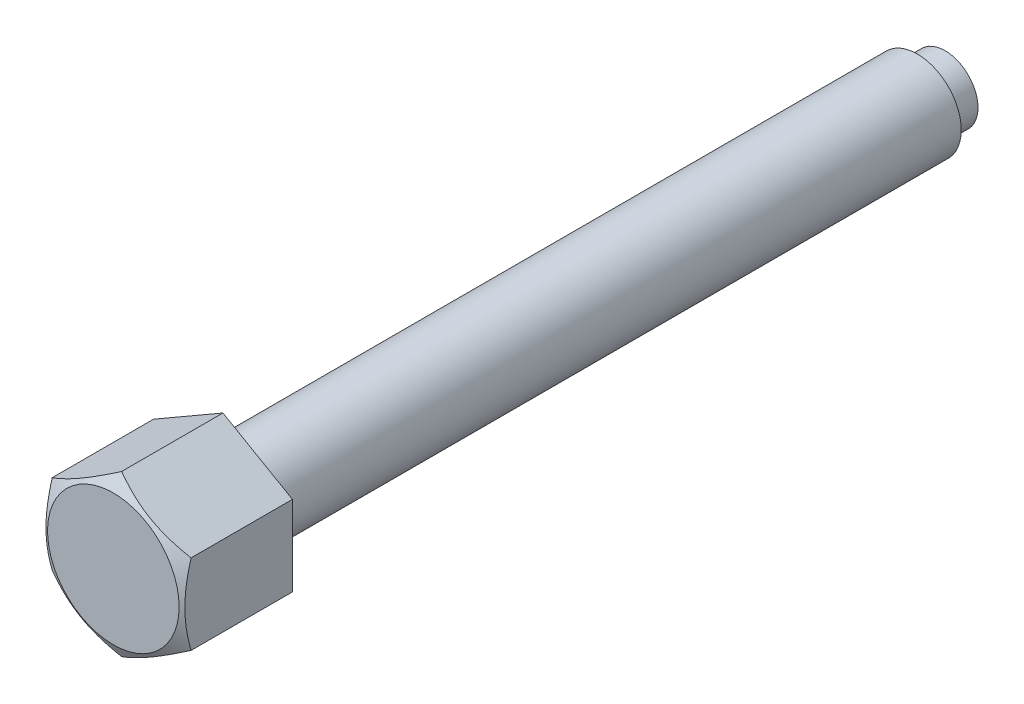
ISO-10303-21;
HEADER;
FILE_DESCRIPTION(('STEP AP214'),'2;1');
FILE_NAME('part.step','',(''),(''),'','','');
FILE_SCHEMA(('AUTOMOTIVE_DESIGN { 1 0 10303 214 1 1 1 1 }'));
ENDSEC;
DATA;
#1=APPLICATION_CONTEXT('core data for automotive mechanical design processes');
#2=APPLICATION_PROTOCOL_DEFINITION('international standard','automotive_design',2000,#1);
#3=PRODUCT_CONTEXT('',#1,'mechanical');
#4=PRODUCT('Part','Part','',(#3));
#5=PRODUCT_RELATED_PRODUCT_CATEGORY('part','',(#4));
#6=PRODUCT_DEFINITION_FORMATION('','',#4);
#7=PRODUCT_DEFINITION_CONTEXT('part definition',#1,'design');
#8=PRODUCT_DEFINITION('design','',#6,#7);
#9=PRODUCT_DEFINITION_SHAPE('','',#8);
#10=(LENGTH_UNIT() NAMED_UNIT(*) SI_UNIT(.MILLI.,.METRE.));
#11=(NAMED_UNIT(*) PLANE_ANGLE_UNIT() SI_UNIT($,.RADIAN.));
#12=(NAMED_UNIT(*) SI_UNIT($,.STERADIAN.) SOLID_ANGLE_UNIT());
#13=UNCERTAINTY_MEASURE_WITH_UNIT(LENGTH_MEASURE(1.E-05),#10,'distance_accuracy_value','');
#14=(GEOMETRIC_REPRESENTATION_CONTEXT(3) GLOBAL_UNCERTAINTY_ASSIGNED_CONTEXT((#13)) GLOBAL_UNIT_ASSIGNED_CONTEXT((#10,
#11,#12)) REPRESENTATION_CONTEXT('',''));
#15=CARTESIAN_POINT('',(0.,0.,0.));
#16=DIRECTION('',(0.,0.,1.));
#17=DIRECTION('',(1.,0.,0.));
#18=AXIS2_PLACEMENT_3D('',#15,#16,#17);
#19=CARTESIAN_POINT('',(0.,10.9696551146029,100.));
#20=DIRECTION('',(-0.5,-0.86602540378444,0.));
#21=DIRECTION('',(0.86602540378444,-0.5,0.));
#22=AXIS2_PLACEMENT_3D('',#19,#20,#21);
#23=PLANE('',#22);
#24=CARTESIAN_POINT('',(9.5002,5.4847120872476,113.862752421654));
#25=CARTESIAN_POINT('',(9.2913692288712,5.60528058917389,113.932351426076));
#26=CARTESIAN_POINT('',(9.0817598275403,5.72629863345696,113.998791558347));
#27=CARTESIAN_POINT('',(8.66086011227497,5.96930519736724,114.124477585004));
#28=CARTESIAN_POINT('',(8.44956926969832,6.09129402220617,114.183721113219));
#29=CARTESIAN_POINT('',(7.81229220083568,6.45922610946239,114.349510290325));
#30=CARTESIAN_POINT('',(7.38379023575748,6.70662183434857,114.443810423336));
#31=CARTESIAN_POINT('',(6.74255666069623,7.0768382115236,114.554386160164));
#32=CARTESIAN_POINT('',(6.53174078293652,7.19855281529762,114.585885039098));
#33=CARTESIAN_POINT('',(6.10913296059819,7.4425455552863,114.638706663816));
#34=CARTESIAN_POINT('',(5.89734099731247,7.56482370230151,114.66002921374));
#35=CARTESIAN_POINT('',(5.47340378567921,7.80958396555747,114.691951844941));
#36=CARTESIAN_POINT('',(5.26125925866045,7.93206566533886,114.702564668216));
#37=CARTESIAN_POINT('',(4.83677424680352,8.17714220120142,114.712842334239));
#38=CARTESIAN_POINT('',(4.62443376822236,8.2997370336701,114.712507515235));
#39=CARTESIAN_POINT('',(4.22745800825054,8.52893109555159,114.701651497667));
#40=CARTESIAN_POINT('',(4.04279470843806,8.63554650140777,114.692454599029));
#41=CARTESIAN_POINT('',(3.67389999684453,8.84852796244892,114.665959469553));
#42=CARTESIAN_POINT('',(3.48966861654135,8.95489399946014,114.648660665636));
#43=CARTESIAN_POINT('',(2.937688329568,9.27357996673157,114.585020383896));
#44=CARTESIAN_POINT('',(2.57091646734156,9.48533580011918,114.526942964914));
#45=CARTESIAN_POINT('',(1.83348217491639,9.91109368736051,114.381748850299));
#46=CARTESIAN_POINT('',(1.46291385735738,10.1250414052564,114.294016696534));
#47=CARTESIAN_POINT('',(0.727303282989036,10.5497463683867,114.094901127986));
#48=CARTESIAN_POINT('',(0.362251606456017,10.7605090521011,113.98356447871));
#49=CARTESIAN_POINT('',(-0.000199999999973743,10.9697705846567,113.862752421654));
#50=B_SPLINE_CURVE_WITH_KNOTS('',3,(#24,#25,#26,#27,#28,#29,#30,#31,#32,#33,#34,#35,#36,#37,#38,
#39,#40,#41,#42,#43,#44,#45,#46,#47,#48,#49),.UNSPECIFIED.,.F.,.F.,(4,2,2,2,2,2,2,2,2,2,2,2,4),
(0.,0.752880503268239,1.50600787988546,3.0154687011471,3.75167336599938,4.48789219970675,
5.22323407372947,5.95855322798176,6.59868084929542,7.23885375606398,8.52010929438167,
9.82978009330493,11.1368800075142),.UNSPECIFIED.);
#51=CARTESIAN_POINT('',(9.5,5.48482755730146,113.862819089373));
#52=VERTEX_POINT('',#51);
#53=CARTESIAN_POINT('',(0.,10.9696551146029,113.862819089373));
#54=VERTEX_POINT('',#53);
#55=EDGE_CURVE('E30',#52,#54,#50,.T.);
#56=ORIENTED_EDGE('',*,*,#55,.F.);
#57=DIRECTION('',(0.,0.,1.));
#58=VECTOR('',#57,1.);
#59=CARTESIAN_POINT('',(9.5,5.48482755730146,100.));
#60=LINE('',#59,#58);
#61=CARTESIAN_POINT('',(9.5,5.48482755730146,100.));
#62=VERTEX_POINT('',#61);
#63=EDGE_CURVE('E100',#62,#52,#60,.T.);
#64=ORIENTED_EDGE('',*,*,#63,.F.);
#65=DIRECTION('',(0.86602540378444,-0.5,0.));
#66=VECTOR('',#65,1.);
#67=CARTESIAN_POINT('',(0.,10.9696551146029,100.));
#68=LINE('',#67,#66);
#69=CARTESIAN_POINT('',(0.,10.9696551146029,100.));
#70=VERTEX_POINT('',#69);
#71=EDGE_CURVE('E38',#70,#62,#68,.T.);
#72=ORIENTED_EDGE('',*,*,#71,.F.);
#73=DIRECTION('',(0.,0.,1.));
#74=VECTOR('',#73,1.);
#75=CARTESIAN_POINT('',(0.,10.9696551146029,100.));
#76=LINE('',#75,#74);
#77=EDGE_CURVE('E88',#70,#54,#76,.T.);
#78=ORIENTED_EDGE('',*,*,#77,.T.);
#79=EDGE_LOOP('',(#56,#64,#72,#78));
#80=FACE_BOUND('',#79,.T.);
#81=ADVANCED_FACE('F15',(#80),#23,.F.);
#82=CARTESIAN_POINT('',(9.5,5.48482755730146,100.));
#83=DIRECTION('',(-1.,0.,0.));
#84=DIRECTION('',(0.,0.,1.));
#85=AXIS2_PLACEMENT_3D('',#82,#83,#84);
#86=PLANE('',#85);
#87=CARTESIAN_POINT('',(9.5,-14.6507799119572,110.114893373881));
#88=CARTESIAN_POINT('',(9.5,-14.4436612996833,110.215224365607));
#89=CARTESIAN_POINT('',(9.5,-14.2362974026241,110.315048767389));
#90=CARTESIAN_POINT('',(9.5,-13.8210278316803,110.513569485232));
#91=CARTESIAN_POINT('',(9.5,-13.6131221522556,110.612265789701));
#92=CARTESIAN_POINT('',(9.5,-12.9884590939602,110.906516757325));
#93=CARTESIAN_POINT('',(9.5,-12.5708182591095,111.100203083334));
#94=CARTESIAN_POINT('',(9.5,-11.7304015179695,111.482466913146));
#95=CARTESIAN_POINT('',(9.5,-11.3076099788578,111.671010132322));
#96=CARTESIAN_POINT('',(9.5,-10.4586359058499,112.040272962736));
#97=CARTESIAN_POINT('',(9.5,-10.0324535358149,112.220992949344));
#98=CARTESIAN_POINT('',(9.5,-9.1625964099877,112.578045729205));
#99=CARTESIAN_POINT('',(9.5,-8.71879180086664,112.754063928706));
#100=CARTESIAN_POINT('',(9.5,-7.82596128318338,113.092578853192));
#101=CARTESIAN_POINT('',(9.5,-7.3769347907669,113.255074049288));
#102=CARTESIAN_POINT('',(9.5,-6.47380793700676,113.562216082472));
#103=CARTESIAN_POINT('',(9.5,-6.01972024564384,113.706899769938));
#104=CARTESIAN_POINT('',(9.5,-5.10504877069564,113.973724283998));
#105=CARTESIAN_POINT('',(9.5,-4.64446710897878,114.09587229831));
#106=CARTESIAN_POINT('',(9.5,-3.71900232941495,114.311057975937));
#107=CARTESIAN_POINT('',(9.5,-3.25415609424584,114.404249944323));
#108=CARTESIAN_POINT('',(9.5,-2.55272029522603,114.518243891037));
#109=CARTESIAN_POINT('',(9.5,-2.31819612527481,114.551944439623));
#110=CARTESIAN_POINT('',(9.5,-1.84801022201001,114.610084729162));
#111=CARTESIAN_POINT('',(9.5,-1.61234860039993,114.634525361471));
#112=CARTESIAN_POINT('',(9.5,-1.14324613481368,114.673356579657));
#113=CARTESIAN_POINT('',(9.5,-0.909815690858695,114.687872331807));
#114=CARTESIAN_POINT('',(9.5,-0.442550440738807,114.707025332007));
#115=CARTESIAN_POINT('',(9.5,-0.208715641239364,114.711662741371));
#116=CARTESIAN_POINT('',(9.5,0.258941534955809,114.71094866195));
#117=CARTESIAN_POINT('',(9.5,0.492763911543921,114.705597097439));
#118=CARTESIAN_POINT('',(9.5,0.959977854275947,114.685034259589));
#119=CARTESIAN_POINT('',(9.5,1.19336939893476,114.66982250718));
#120=CARTESIAN_POINT('',(9.5,1.75678418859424,114.621518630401));
#121=CARTESIAN_POINT('',(9.5,2.0864015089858,114.583609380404));
#122=CARTESIAN_POINT('',(9.5,2.74313739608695,114.490208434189));
#123=CARTESIAN_POINT('',(9.5,3.07025560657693,114.434714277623));
#124=CARTESIAN_POINT('',(9.5,3.72169913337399,114.308117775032));
#125=CARTESIAN_POINT('',(9.5,4.04602201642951,114.237003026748));
#126=CARTESIAN_POINT('',(9.5,4.6913890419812,114.081330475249));
#127=CARTESIAN_POINT('',(9.5,5.01243323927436,113.996772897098));
#128=CARTESIAN_POINT('',(9.5,5.65827210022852,113.814277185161));
#129=CARTESIAN_POINT('',(9.5,5.98299492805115,113.716086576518));
#130=CARTESIAN_POINT('',(9.5,6.62924078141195,113.509739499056));
#131=CARTESIAN_POINT('',(9.5,6.95076378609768,113.401582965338));
#132=CARTESIAN_POINT('',(9.5,7.59077221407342,113.177005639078));
#133=CARTESIAN_POINT('',(9.5,7.90925864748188,113.06058771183));
#134=CARTESIAN_POINT('',(9.5,8.54360425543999,112.820839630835));
#135=CARTESIAN_POINT('',(9.5,8.85946345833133,112.697509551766));
#136=CARTESIAN_POINT('',(9.5,9.59494265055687,112.402539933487));
#137=CARTESIAN_POINT('',(9.5,10.0136502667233,112.228629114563));
#138=CARTESIAN_POINT('',(9.5,10.8475974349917,111.87265923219));
#139=CARTESIAN_POINT('',(9.5,11.2628367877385,111.690599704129));
#140=CARTESIAN_POINT('',(9.5,12.0904812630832,111.319938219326));
#141=CARTESIAN_POINT('',(9.5,12.5028857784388,111.131334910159));
#142=CARTESIAN_POINT('',(9.5,13.325239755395,110.74888317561));
#143=CARTESIAN_POINT('',(9.5,13.7351892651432,110.555034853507));
#144=CARTESIAN_POINT('',(9.5,14.5534588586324,110.162856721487));
#145=CARTESIAN_POINT('',(9.5,14.9617768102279,109.964522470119));
#146=CARTESIAN_POINT('',(9.5,15.7766753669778,109.564317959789));
#147=CARTESIAN_POINT('',(9.5,16.1832559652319,109.362447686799));
#148=CARTESIAN_POINT('',(9.5,17.4007037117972,108.752507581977));
#149=CARTESIAN_POINT('',(9.5,18.2093773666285,108.340059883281));
#150=CARTESIAN_POINT('',(9.5,19.7565044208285,107.54097414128));
#151=CARTESIAN_POINT('',(9.5,20.4952933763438,107.154982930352));
#152=CARTESIAN_POINT('',(9.5,21.9701265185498,106.37773711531));
#153=CARTESIAN_POINT('',(9.5,22.7061706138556,105.986482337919));
#154=CARTESIAN_POINT('',(9.5,24.1743637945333,105.200888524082));
#155=CARTESIAN_POINT('',(9.5,24.906517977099,104.806558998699));
#156=CARTESIAN_POINT('',(9.5,26.3690658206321,104.014738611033));
#157=CARTESIAN_POINT('',(9.5,27.0994595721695,103.617247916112));
#158=CARTESIAN_POINT('',(9.5,27.8292025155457,103.218573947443));
#159=B_SPLINE_CURVE_WITH_KNOTS('',3,(#87,#88,#89,#90,#91,#92,#93,#94,#95,#96,#97,#98,#99,#100,
#101,#102,#103,#104,#105,#106,#107,#108,#109,#110,#111,#112,#113,#114,#115,#116,#117,#118,#119,
#120,#121,#122,#123,#124,#125,#126,#127,#128,#129,#130,#131,#132,#133,#134,#135,#136,#137,#138,
#139,#140,#141,#142,#143,#144,#145,#146,#147,#148,#149,#150,#151,#152,#153,#154,#155,#156,#157,
#158),.UNSPECIFIED.,.F.,.F.,(4,2,2,2,2,2,2,2,2,2,2,2,2,2,2,2,2,2,2,2,2,2,2,2,2,2,2,2,2,2,2,2,2,
2,2,4),(0.,0.690418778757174,1.38084464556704,2.76190503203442,4.15062357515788,
5.53927541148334,6.97141195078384,8.40371018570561,9.832993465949,11.2618200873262,
12.6828965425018,13.3935418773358,14.1041187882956,14.8055603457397,15.5069904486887,
16.208425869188,16.9098953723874,17.9047134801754,18.8996708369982,19.8954210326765,
20.8911545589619,21.9086941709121,22.9262404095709,23.9434354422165,24.9606194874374,
26.3206685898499,27.6807953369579,29.0412048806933,30.4015876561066,31.7633820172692,
33.1251817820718,35.8484463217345,38.3490605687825,40.8497573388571,43.344525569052,
45.8391625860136),.UNSPECIFIED.);
#160=CARTESIAN_POINT('',(9.5,-5.48482755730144,113.862819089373));
#161=VERTEX_POINT('',#160);
#162=EDGE_CURVE('E147',#161,#52,#159,.T.);
#163=ORIENTED_EDGE('',*,*,#162,.F.);
#164=DIRECTION('',(0.,0.,1.));
#165=VECTOR('',#164,1.);
#166=CARTESIAN_POINT('',(9.5,-5.48482755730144,100.));
#167=LINE('',#166,#165);
#168=CARTESIAN_POINT('',(9.5,-5.48482755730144,100.));
#169=VERTEX_POINT('',#168);
#170=EDGE_CURVE('E97',#169,#161,#167,.T.);
#171=ORIENTED_EDGE('',*,*,#170,.F.);
#172=DIRECTION('',(0.,-1.,0.));
#173=VECTOR('',#172,1.);
#174=CARTESIAN_POINT('',(9.5,5.48482755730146,100.));
#175=LINE('',#174,#173);
#176=EDGE_CURVE('E162',#62,#169,#175,.T.);
#177=ORIENTED_EDGE('',*,*,#176,.F.);
#178=ORIENTED_EDGE('',*,*,#63,.T.);
#179=EDGE_LOOP('',(#163,#171,#177,#178));
#180=FACE_BOUND('',#179,.T.);
#181=ADVANCED_FACE('F126',(#180),#86,.F.);
#182=CARTESIAN_POINT('',(0.,-10.9696551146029,100.));
#183=DIRECTION('',(0.5,-0.866025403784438,0.));
#184=DIRECTION('',(0.866025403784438,0.5,0.));
#185=AXIS2_PLACEMENT_3D('',#182,#183,#184);
#186=PLANE('',#185);
#187=ORIENTED_EDGE('',*,*,#170,.T.);
#188=CARTESIAN_POINT('',(9.5002,-5.4847120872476,113.862752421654));
#189=CARTESIAN_POINT('',(9.2913692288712,-5.60528058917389,113.932351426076));
#190=CARTESIAN_POINT('',(9.0817598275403,-5.72629863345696,113.998791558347));
#191=CARTESIAN_POINT('',(8.66086011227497,-5.96930519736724,114.124477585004));
#192=CARTESIAN_POINT('',(8.44956926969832,-6.09129402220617,114.183721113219));
#193=CARTESIAN_POINT('',(7.81229220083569,-6.45922610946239,114.349510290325));
#194=CARTESIAN_POINT('',(7.38379023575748,-6.70662183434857,114.443810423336));
#195=CARTESIAN_POINT('',(6.74255666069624,-7.0768382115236,114.554386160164));
#196=CARTESIAN_POINT('',(6.53174078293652,-7.19855281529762,114.585885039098));
#197=CARTESIAN_POINT('',(6.10913296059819,-7.4425455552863,114.638706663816));
#198=CARTESIAN_POINT('',(5.89734099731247,-7.56482370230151,114.66002921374));
#199=CARTESIAN_POINT('',(5.47340378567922,-7.80958396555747,114.691951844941));
#200=CARTESIAN_POINT('',(5.26125925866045,-7.93206566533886,114.702564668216));
#201=CARTESIAN_POINT('',(4.83677424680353,-8.17714220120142,114.712842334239));
#202=CARTESIAN_POINT('',(4.62443376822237,-8.2997370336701,114.712507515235));
#203=CARTESIAN_POINT('',(4.22745800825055,-8.52893109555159,114.701651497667));
#204=CARTESIAN_POINT('',(4.04279470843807,-8.63554650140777,114.692454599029));
#205=CARTESIAN_POINT('',(3.67389999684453,-8.84852796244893,114.665959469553));
#206=CARTESIAN_POINT('',(3.48966861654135,-8.95489399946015,114.648660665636));
#207=CARTESIAN_POINT('',(2.93768832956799,-9.27357996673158,114.585020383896));
#208=CARTESIAN_POINT('',(2.57091646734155,-9.4853358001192,114.526942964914));
#209=CARTESIAN_POINT('',(1.83348217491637,-9.91109368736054,114.381748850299));
#210=CARTESIAN_POINT('',(1.46291385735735,-10.1250414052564,114.294016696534));
#211=CARTESIAN_POINT('',(0.727303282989,-10.5497463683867,114.094901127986));
#212=CARTESIAN_POINT('',(0.362251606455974,-10.7605090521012,113.98356447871));
#213=CARTESIAN_POINT('',(-0.000200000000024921,-10.9697705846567,113.862752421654));
#214=B_SPLINE_CURVE_WITH_KNOTS('',3,(#188,#189,#190,#191,#192,#193,#194,#195,#196,#197,#198,
#199,#200,#201,#202,#203,#204,#205,#206,#207,#208,#209,#210,#211,#212,#213),.UNSPECIFIED.,.F.,
.F.,(4,2,2,2,2,2,2,2,2,2,2,2,4),(0.,0.752880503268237,1.50600787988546,3.0154687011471,
3.75167336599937,4.48789219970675,5.22323407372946,5.95855322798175,6.59868084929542,
7.23885375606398,8.5201092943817,9.82978009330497,11.1368800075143),.UNSPECIFIED.);
#215=CARTESIAN_POINT('',(0.,-10.9696551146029,113.862819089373));
#216=VERTEX_POINT('',#215);
#217=EDGE_CURVE('E173',#161,#216,#214,.T.);
#218=ORIENTED_EDGE('',*,*,#217,.T.);
#219=DIRECTION('',(0.,0.,1.));
#220=VECTOR('',#219,1.);
#221=CARTESIAN_POINT('',(0.,-10.9696551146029,100.));
#222=LINE('',#221,#220);
#223=CARTESIAN_POINT('',(0.,-10.9696551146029,100.));
#224=VERTEX_POINT('',#223);
#225=EDGE_CURVE('E90',#224,#216,#222,.T.);
#226=ORIENTED_EDGE('',*,*,#225,.F.);
#227=DIRECTION('',(0.866025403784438,0.5,0.));
#228=VECTOR('',#227,1.);
#229=CARTESIAN_POINT('',(0.,-10.9696551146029,100.));
#230=LINE('',#229,#228);
#231=EDGE_CURVE('E159',#224,#169,#230,.T.);
#232=ORIENTED_EDGE('',*,*,#231,.T.);
#233=EDGE_LOOP('',(#187,#218,#226,#232));
#234=FACE_BOUND('',#233,.T.);
#235=ADVANCED_FACE('F131',(#234),#186,.T.);
#236=CARTESIAN_POINT('',(0.,-10.9696551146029,100.));
#237=DIRECTION('',(0.5,0.866025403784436,0.));
#238=DIRECTION('',(-0.866025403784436,0.5,0.));
#239=AXIS2_PLACEMENT_3D('',#236,#237,#238);
#240=PLANE('',#239);
#241=CARTESIAN_POINT('',(-9.5002,-5.48471208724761,113.862752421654));
#242=CARTESIAN_POINT('',(-9.29136922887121,-5.6052805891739,113.932351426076));
#243=CARTESIAN_POINT('',(-9.0817598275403,-5.72629863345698,113.998791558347));
#244=CARTESIAN_POINT('',(-8.66086011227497,-5.96930519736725,114.124477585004));
#245=CARTESIAN_POINT('',(-8.44956926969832,-6.09129402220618,114.183721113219));
#246=CARTESIAN_POINT('',(-7.81229220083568,-6.4592261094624,114.349510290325));
#247=CARTESIAN_POINT('',(-7.38379023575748,-6.70662183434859,114.443810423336));
#248=CARTESIAN_POINT('',(-6.74255666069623,-7.07683821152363,114.554386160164));
#249=CARTESIAN_POINT('',(-6.53174078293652,-7.19855281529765,114.585885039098));
#250=CARTESIAN_POINT('',(-6.10913296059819,-7.44254555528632,114.638706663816));
#251=CARTESIAN_POINT('',(-5.89734099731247,-7.56482370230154,114.66002921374));
#252=CARTESIAN_POINT('',(-5.47340378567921,-7.80958396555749,114.691951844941));
#253=CARTESIAN_POINT('',(-5.26125925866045,-7.93206566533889,114.702564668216));
#254=CARTESIAN_POINT('',(-4.83677424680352,-8.17714220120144,114.712842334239));
#255=CARTESIAN_POINT('',(-4.62443376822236,-8.29973703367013,114.712507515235));
#256=CARTESIAN_POINT('',(-4.22745800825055,-8.52893109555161,114.701651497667));
#257=CARTESIAN_POINT('',(-4.04279470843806,-8.6355465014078,114.692454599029));
#258=CARTESIAN_POINT('',(-3.67389999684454,-8.84852796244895,114.665959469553));
#259=CARTESIAN_POINT('',(-3.48966861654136,-8.95489399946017,114.648660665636));
#260=CARTESIAN_POINT('',(-2.937688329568,-9.2735799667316,114.585020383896));
#261=CARTESIAN_POINT('',(-2.57091646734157,-9.48533580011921,114.526942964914));
#262=CARTESIAN_POINT('',(-1.8334821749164,-9.91109368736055,114.381748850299));
#263=CARTESIAN_POINT('',(-1.46291385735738,-10.1250414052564,114.294016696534));
#264=CARTESIAN_POINT('',(-0.727303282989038,-10.5497463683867,114.094901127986));
#265=CARTESIAN_POINT('',(-0.362251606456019,-10.7605090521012,113.98356447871));
#266=CARTESIAN_POINT('',(0.000199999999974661,-10.9697705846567,113.862752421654));
#267=B_SPLINE_CURVE_WITH_KNOTS('',3,(#241,#242,#243,#244,#245,#246,#247,#248,#249,#250,#251,
#252,#253,#254,#255,#256,#257,#258,#259,#260,#261,#262,#263,#264,#265,#266),.UNSPECIFIED.,.F.,
.F.,(4,2,2,2,2,2,2,2,2,2,2,2,4),(0.,0.75288050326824,1.50600787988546,3.0154687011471,
3.75167336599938,4.48789219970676,5.22323407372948,5.95855322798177,6.59868084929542,
7.23885375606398,8.52010929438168,9.82978009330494,11.1368800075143),.UNSPECIFIED.);
#268=CARTESIAN_POINT('',(-9.5,-5.48482755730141,113.862819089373));
#269=VERTEX_POINT('',#268);
#270=EDGE_CURVE('E82',#269,#216,#267,.T.);
#271=ORIENTED_EDGE('',*,*,#270,.F.);
#272=DIRECTION('',(0.,0.,1.));
#273=VECTOR('',#272,1.);
#274=CARTESIAN_POINT('',(-9.5,-5.48482755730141,100.));
#275=LINE('',#274,#273);
#276=CARTESIAN_POINT('',(-9.5,-5.48482755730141,100.));
#277=VERTEX_POINT('',#276);
#278=EDGE_CURVE('E81',#277,#269,#275,.T.);
#279=ORIENTED_EDGE('',*,*,#278,.F.);
#280=DIRECTION('',(-0.866025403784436,0.5,0.));
#281=VECTOR('',#280,1.);
#282=CARTESIAN_POINT('',(0.,-10.9696551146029,100.));
#283=LINE('',#282,#281);
#284=EDGE_CURVE('E156',#224,#277,#283,.T.);
#285=ORIENTED_EDGE('',*,*,#284,.F.);
#286=ORIENTED_EDGE('',*,*,#225,.T.);
#287=EDGE_LOOP('',(#271,#279,#285,#286));
#288=FACE_BOUND('',#287,.T.);
#289=ADVANCED_FACE('F171',(#288),#240,.F.);
#290=CARTESIAN_POINT('',(-9.5,5.48482755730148,100.));
#291=DIRECTION('',(-1.,0.,0.));
#292=DIRECTION('',(0.,0.,1.));
#293=AXIS2_PLACEMENT_3D('',#290,#291,#292);
#294=PLANE('',#293);
#295=ORIENTED_EDGE('',*,*,#278,.T.);
#296=CARTESIAN_POINT('',(-9.5,-14.6507799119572,110.114893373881));
#297=CARTESIAN_POINT('',(-9.5,-14.4436612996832,110.215224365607));
#298=CARTESIAN_POINT('',(-9.5,-14.2362974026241,110.315048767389));
#299=CARTESIAN_POINT('',(-9.5,-13.8210278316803,110.513569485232));
#300=CARTESIAN_POINT('',(-9.5,-13.6131221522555,110.612265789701));
#301=CARTESIAN_POINT('',(-9.5,-12.9884590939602,110.906516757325));
#302=CARTESIAN_POINT('',(-9.5,-12.5708182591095,111.100203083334));
#303=CARTESIAN_POINT('',(-9.5,-11.7304015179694,111.482466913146));
#304=CARTESIAN_POINT('',(-9.5,-11.3076099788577,111.671010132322));
#305=CARTESIAN_POINT('',(-9.5,-10.4586359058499,112.040272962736));
#306=CARTESIAN_POINT('',(-9.5,-10.0324535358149,112.220992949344));
#307=CARTESIAN_POINT('',(-9.5,-9.16259640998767,112.578045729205));
#308=CARTESIAN_POINT('',(-9.5,-8.71879180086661,112.754063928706));
#309=CARTESIAN_POINT('',(-9.5,-7.82596128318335,113.092578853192));
#310=CARTESIAN_POINT('',(-9.5,-7.37693479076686,113.255074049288));
#311=CARTESIAN_POINT('',(-9.5,-6.47380793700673,113.562216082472));
#312=CARTESIAN_POINT('',(-9.5,-6.01972024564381,113.706899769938));
#313=CARTESIAN_POINT('',(-9.5,-5.10504877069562,113.973724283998));
#314=CARTESIAN_POINT('',(-9.5,-4.64446710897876,114.09587229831));
#315=CARTESIAN_POINT('',(-9.5,-3.71900232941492,114.311057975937));
#316=CARTESIAN_POINT('',(-9.5,-3.25415609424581,114.404249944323));
#317=CARTESIAN_POINT('',(-9.5,-2.552720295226,114.518243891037));
#318=CARTESIAN_POINT('',(-9.5,-2.31819612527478,114.551944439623));
#319=CARTESIAN_POINT('',(-9.5,-1.84801022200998,114.610084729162));
#320=CARTESIAN_POINT('',(-9.5,-1.6123486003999,114.634525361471));
#321=CARTESIAN_POINT('',(-9.5,-1.14324613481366,114.673356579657));
#322=CARTESIAN_POINT('',(-9.5,-0.909815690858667,114.687872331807));
#323=CARTESIAN_POINT('',(-9.5,-0.442550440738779,114.707025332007));
#324=CARTESIAN_POINT('',(-9.5,-0.208715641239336,114.711662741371));
#325=CARTESIAN_POINT('',(-9.5,0.258941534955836,114.71094866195));
#326=CARTESIAN_POINT('',(-9.5,0.492763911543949,114.705597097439));
#327=CARTESIAN_POINT('',(-9.5,0.959977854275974,114.685034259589));
#328=CARTESIAN_POINT('',(-9.5,1.19336939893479,114.66982250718));
#329=CARTESIAN_POINT('',(-9.5,1.75678418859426,114.621518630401));
#330=CARTESIAN_POINT('',(-9.5,2.08640150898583,114.583609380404));
#331=CARTESIAN_POINT('',(-9.5,2.74313739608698,114.490208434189));
#332=CARTESIAN_POINT('',(-9.5,3.07025560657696,114.434714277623));
#333=CARTESIAN_POINT('',(-9.5,3.72169913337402,114.308117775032));
#334=CARTESIAN_POINT('',(-9.5,4.04602201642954,114.237003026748));
#335=CARTESIAN_POINT('',(-9.5,4.69138904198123,114.081330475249));
#336=CARTESIAN_POINT('',(-9.5,5.01243323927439,113.996772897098));
#337=CARTESIAN_POINT('',(-9.5,5.65827210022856,113.814277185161));
#338=CARTESIAN_POINT('',(-9.5,5.98299492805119,113.716086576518));
#339=CARTESIAN_POINT('',(-9.5,6.62924078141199,113.509739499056));
#340=CARTESIAN_POINT('',(-9.5,6.95076378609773,113.401582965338));
#341=CARTESIAN_POINT('',(-9.5,7.59077221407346,113.177005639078));
#342=CARTESIAN_POINT('',(-9.5,7.90925864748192,113.06058771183));
#343=CARTESIAN_POINT('',(-9.5,8.54360425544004,112.820839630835));
#344=CARTESIAN_POINT('',(-9.5,8.85946345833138,112.697509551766));
#345=CARTESIAN_POINT('',(-9.5,9.59494265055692,112.402539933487));
#346=CARTESIAN_POINT('',(-9.5,10.0136502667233,112.228629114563));
#347=CARTESIAN_POINT('',(-9.5,10.8475974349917,111.87265923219));
#348=CARTESIAN_POINT('',(-9.5,11.2628367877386,111.690599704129));
#349=CARTESIAN_POINT('',(-9.5,12.0904812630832,111.319938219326));
#350=CARTESIAN_POINT('',(-9.5,12.5028857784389,111.131334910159));
#351=CARTESIAN_POINT('',(-9.5,13.3252397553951,110.74888317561));
#352=CARTESIAN_POINT('',(-9.5,13.7351892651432,110.555034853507));
#353=CARTESIAN_POINT('',(-9.5,14.5534588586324,110.162856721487));
#354=CARTESIAN_POINT('',(-9.5,14.9617768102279,109.964522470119));
#355=CARTESIAN_POINT('',(-9.5,15.7766753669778,109.564317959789));
#356=CARTESIAN_POINT('',(-9.5,16.1832559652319,109.362447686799));
#357=CARTESIAN_POINT('',(-9.5,17.4007037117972,108.752507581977));
#358=CARTESIAN_POINT('',(-9.5,18.2093773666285,108.340059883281));
#359=CARTESIAN_POINT('',(-9.5,19.7565044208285,107.54097414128));
#360=CARTESIAN_POINT('',(-9.5,20.4952933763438,107.154982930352));
#361=CARTESIAN_POINT('',(-9.5,21.9701265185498,106.37773711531));
#362=CARTESIAN_POINT('',(-9.5,22.7061706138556,105.986482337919));
#363=CARTESIAN_POINT('',(-9.5,24.1743637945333,105.200888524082));
#364=CARTESIAN_POINT('',(-9.5,24.906517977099,104.806558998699));
#365=CARTESIAN_POINT('',(-9.5,26.3690658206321,104.014738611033));
#366=CARTESIAN_POINT('',(-9.5,27.0994595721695,103.617247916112));
#367=CARTESIAN_POINT('',(-9.5,27.8292025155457,103.218573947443));
#368=B_SPLINE_CURVE_WITH_KNOTS('',3,(#296,#297,#298,#299,#300,#301,#302,#303,#304,#305,#306,
#307,#308,#309,#310,#311,#312,#313,#314,#315,#316,#317,#318,#319,#320,#321,#322,#323,#324,#325,
#326,#327,#328,#329,#330,#331,#332,#333,#334,#335,#336,#337,#338,#339,#340,#341,#342,#343,#344,
#345,#346,#347,#348,#349,#350,#351,#352,#353,#354,#355,#356,#357,#358,#359,#360,#361,#362,#363,
#364,#365,#366,#367),.UNSPECIFIED.,.F.,.F.,(4,2,2,2,2,2,2,2,2,2,2,2,2,2,2,2,2,2,2,2,2,2,2,2,2,2,
2,2,2,2,2,2,2,2,2,4),(0.,0.690418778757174,1.38084464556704,2.76190503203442,4.15062357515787,
5.53927541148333,6.97141195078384,8.4037101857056,9.83299346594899,11.2618200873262,
12.6828965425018,13.3935418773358,14.1041187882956,14.8055603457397,15.5069904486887,
16.208425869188,16.9098953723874,17.9047134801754,18.8996708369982,19.8954210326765,
20.8911545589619,21.9086941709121,22.9262404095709,23.9434354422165,24.9606194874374,
26.3206685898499,27.680795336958,29.0412048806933,30.4015876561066,31.7633820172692,
33.1251817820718,35.8484463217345,38.3490605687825,40.8497573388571,43.344525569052,
45.8391625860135),.UNSPECIFIED.);
#369=CARTESIAN_POINT('',(-9.5,5.48482755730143,113.862819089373));
#370=VERTEX_POINT('',#369);
#371=EDGE_CURVE('E69',#269,#370,#368,.T.);
#372=ORIENTED_EDGE('',*,*,#371,.T.);
#373=DIRECTION('',(0.,0.,1.));
#374=VECTOR('',#373,1.);
#375=CARTESIAN_POINT('',(-9.5,5.48482755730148,100.));
#376=LINE('',#375,#374);
#377=CARTESIAN_POINT('',(-9.5,5.48482755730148,100.));
#378=VERTEX_POINT('',#377);
#379=EDGE_CURVE('E79',#378,#370,#376,.T.);
#380=ORIENTED_EDGE('',*,*,#379,.F.);
#381=DIRECTION('',(0.,-1.,0.));
#382=VECTOR('',#381,1.);
#383=CARTESIAN_POINT('',(-9.5,5.48482755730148,100.));
#384=LINE('',#383,#382);
#385=EDGE_CURVE('E154',#378,#277,#384,.T.);
#386=ORIENTED_EDGE('',*,*,#385,.T.);
#387=EDGE_LOOP('',(#295,#372,#380,#386));
#388=FACE_BOUND('',#387,.T.);
#389=ADVANCED_FACE('F77',(#388),#294,.T.);
#390=CARTESIAN_POINT('',(0.,10.9696551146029,100.));
#391=DIRECTION('',(-0.5,0.866025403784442,0.));
#392=DIRECTION('',(-0.866025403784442,-0.5,0.));
#393=AXIS2_PLACEMENT_3D('',#390,#391,#392);
#394=PLANE('',#393);
#395=ORIENTED_EDGE('',*,*,#379,.T.);
#396=CARTESIAN_POINT('',(-9.5002,5.48471208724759,113.862752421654));
#397=CARTESIAN_POINT('',(-9.2913692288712,5.60528058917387,113.932351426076));
#398=CARTESIAN_POINT('',(-9.0817598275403,5.72629863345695,113.998791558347));
#399=CARTESIAN_POINT('',(-8.66086011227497,5.96930519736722,114.124477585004));
#400=CARTESIAN_POINT('',(-8.44956926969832,6.09129402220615,114.183721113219));
#401=CARTESIAN_POINT('',(-7.81229220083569,6.45922610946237,114.349510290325));
#402=CARTESIAN_POINT('',(-7.38379023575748,6.70662183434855,114.443810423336));
#403=CARTESIAN_POINT('',(-6.74255666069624,7.07683821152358,114.554386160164));
#404=CARTESIAN_POINT('',(-6.53174078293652,7.1985528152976,114.585885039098));
#405=CARTESIAN_POINT('',(-6.1091329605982,7.44254555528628,114.638706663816));
#406=CARTESIAN_POINT('',(-5.89734099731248,7.56482370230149,114.66002921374));
#407=CARTESIAN_POINT('',(-5.47340378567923,7.80958396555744,114.691951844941));
#408=CARTESIAN_POINT('',(-5.26125925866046,7.93206566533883,114.702564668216));
#409=CARTESIAN_POINT('',(-4.83677424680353,8.17714220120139,114.712842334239));
#410=CARTESIAN_POINT('',(-4.62443376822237,8.29973703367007,114.712507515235));
#411=CARTESIAN_POINT('',(-4.22745800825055,8.52893109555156,114.701651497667));
#412=CARTESIAN_POINT('',(-4.04279470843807,8.63554650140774,114.692454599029));
#413=CARTESIAN_POINT('',(-3.67389999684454,8.8485279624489,114.665959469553));
#414=CARTESIAN_POINT('',(-3.48966861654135,8.95489399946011,114.648660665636));
#415=CARTESIAN_POINT('',(-2.93768832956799,9.27357996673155,114.585020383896));
#416=CARTESIAN_POINT('',(-2.57091646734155,9.48533580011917,114.526942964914));
#417=CARTESIAN_POINT('',(-1.83348217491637,9.91109368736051,114.381748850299));
#418=CARTESIAN_POINT('',(-1.46291385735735,10.1250414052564,114.294016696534));
#419=CARTESIAN_POINT('',(-0.727303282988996,10.5497463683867,114.094901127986));
#420=CARTESIAN_POINT('',(-0.362251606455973,10.7605090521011,113.98356447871));
#421=CARTESIAN_POINT('',(0.000200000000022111,10.9697705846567,113.862752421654));
#422=B_SPLINE_CURVE_WITH_KNOTS('',3,(#396,#397,#398,#399,#400,#401,#402,#403,#404,#405,#406,
#407,#408,#409,#410,#411,#412,#413,#414,#415,#416,#417,#418,#419,#420,#421),.UNSPECIFIED.,.F.,
.F.,(4,2,2,2,2,2,2,2,2,2,2,2,4),(0.,0.752880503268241,1.50600787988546,3.01546870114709,
3.75167336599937,4.48789219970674,5.22323407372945,5.95855322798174,6.59868084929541,
7.23885375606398,8.52010929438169,9.82978009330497,11.1368800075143),.UNSPECIFIED.);
#423=EDGE_CURVE('E66',#370,#54,#422,.T.);
#424=ORIENTED_EDGE('',*,*,#423,.T.);
#425=ORIENTED_EDGE('',*,*,#77,.F.);
#426=DIRECTION('',(-0.866025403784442,-0.5,0.));
#427=VECTOR('',#426,1.);
#428=CARTESIAN_POINT('',(0.,10.9696551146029,100.));
#429=LINE('',#428,#427);
#430=EDGE_CURVE('E86',#70,#378,#429,.T.);
#431=ORIENTED_EDGE('',*,*,#430,.T.);
#432=EDGE_LOOP('',(#395,#424,#425,#431));
#433=FACE_BOUND('',#432,.T.);
#434=ADVANCED_FACE('F84',(#433),#394,.T.);
#435=CARTESIAN_POINT('',(0.,0.,9.));
#436=DIRECTION('',(0.,0.,1.));
#437=DIRECTION('',(1.,0.,0.));
#438=AXIS2_PLACEMENT_3D('',#435,#436,#437);
#439=SPHERICAL_SURFACE('',#438,9.);
#440=CARTESIAN_POINT('',(0.,0.,1.20577136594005));
#441=DIRECTION('',(0.,0.,1.));
#442=DIRECTION('',(1.,0.,0.));
#443=AXIS2_PLACEMENT_3D('',#440,#441,#442);
#444=CIRCLE('',#443,4.5);
#445=CARTESIAN_POINT('',(4.5,0.,1.20577136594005));
#446=VERTEX_POINT('',#445);
#447=EDGE_CURVE('E9',#446,#446,#444,.T.);
#448=ORIENTED_EDGE('',*,*,#447,.F.);
#449=EDGE_LOOP('',(#448));
#450=FACE_BOUND('',#449,.T.);
#451=ADVANCED_FACE('F17',(#450),#439,.T.);
#452=CARTESIAN_POINT('',(0.,0.,110.));
#453=DIRECTION('',(0.,0.,1.));
#454=DIRECTION('',(1.,0.,0.));
#455=AXIS2_PLACEMENT_3D('',#452,#453,#454);
#456=CYLINDRICAL_SURFACE('',#455,4.5);
#457=ORIENTED_EDGE('',*,*,#447,.T.);
#458=EDGE_LOOP('',(#457));
#459=FACE_BOUND('',#458,.T.);
#460=CARTESIAN_POINT('',(0.,0.,5.));
#461=DIRECTION('',(0.,0.,1.));
#462=DIRECTION('',(1.,0.,0.));
#463=AXIS2_PLACEMENT_3D('',#460,#461,#462);
#464=CIRCLE('',#463,4.5);
#465=CARTESIAN_POINT('',(4.5,0.,5.));
#466=VERTEX_POINT('',#465);
#467=EDGE_CURVE('E23',#466,#466,#464,.T.);
#468=ORIENTED_EDGE('',*,*,#467,.F.);
#469=EDGE_LOOP('',(#468));
#470=FACE_BOUND('',#469,.T.);
#471=ADVANCED_FACE('F113',(#459,#470),#456,.T.);
#472=CARTESIAN_POINT('',(4.5,0.,5.));
#473=DIRECTION('',(0.,0.,1.));
#474=DIRECTION('',(1.,0.,0.));
#475=AXIS2_PLACEMENT_3D('',#472,#473,#474);
#476=PLANE('',#475);
#477=CARTESIAN_POINT('',(0.,0.,5.));
#478=DIRECTION('',(0.,0.,1.));
#479=DIRECTION('',(1.,0.,0.));
#480=AXIS2_PLACEMENT_3D('',#477,#478,#479);
#481=CIRCLE('',#480,6.);
#482=CARTESIAN_POINT('',(6.,0.,5.));
#483=VERTEX_POINT('',#482);
#484=EDGE_CURVE('E106',#483,#483,#481,.T.);
#485=ORIENTED_EDGE('',*,*,#484,.F.);
#486=EDGE_LOOP('',(#485));
#487=FACE_BOUND('',#486,.T.);
#488=ORIENTED_EDGE('',*,*,#467,.T.);
#489=EDGE_LOOP('',(#488));
#490=FACE_BOUND('',#489,.T.);
#491=ADVANCED_FACE('F111',(#487,#490),#476,.F.);
#492=CARTESIAN_POINT('',(0.,0.,110.));
#493=DIRECTION('',(0.,0.,1.));
#494=DIRECTION('',(1.,0.,0.));
#495=AXIS2_PLACEMENT_3D('',#492,#493,#494);
#496=CYLINDRICAL_SURFACE('',#495,6.);
#497=CARTESIAN_POINT('',(0.,0.,100.));
#498=DIRECTION('',(0.,0.,1.));
#499=DIRECTION('',(1.,0.,0.));
#500=AXIS2_PLACEMENT_3D('',#497,#498,#499);
#501=CIRCLE('',#500,6.);
#502=CARTESIAN_POINT('',(6.,0.,100.));
#503=VERTEX_POINT('',#502);
#504=EDGE_CURVE('E103',#503,#503,#501,.T.);
#505=ORIENTED_EDGE('',*,*,#504,.F.);
#506=EDGE_LOOP('',(#505));
#507=FACE_BOUND('',#506,.T.);
#508=ORIENTED_EDGE('',*,*,#484,.T.);
#509=EDGE_LOOP('',(#508));
#510=FACE_BOUND('',#509,.T.);
#511=ADVANCED_FACE('F121',(#507,#510),#496,.T.);
#512=CARTESIAN_POINT('',(6.,0.,100.));
#513=DIRECTION('',(0.,0.,1.));
#514=DIRECTION('',(1.,0.,0.));
#515=AXIS2_PLACEMENT_3D('',#512,#513,#514);
#516=PLANE('',#515);
#517=ORIENTED_EDGE('',*,*,#430,.F.);
#518=ORIENTED_EDGE('',*,*,#71,.T.);
#519=ORIENTED_EDGE('',*,*,#176,.T.);
#520=ORIENTED_EDGE('',*,*,#231,.F.);
#521=ORIENTED_EDGE('',*,*,#284,.T.);
#522=ORIENTED_EDGE('',*,*,#385,.F.);
#523=EDGE_LOOP('',(#517,#518,#519,#520,#521,#522));
#524=FACE_BOUND('',#523,.T.);
#525=ORIENTED_EDGE('',*,*,#504,.T.);
#526=EDGE_LOOP('',(#525));
#527=FACE_BOUND('',#526,.T.);
#528=ADVANCED_FACE('F165',(#524,#527),#516,.F.);
#529=CARTESIAN_POINT('',(0.,0.,115.));
#530=DIRECTION('',(0.,0.,-1.));
#531=DIRECTION('',(-1.,0.,0.));
#532=AXIS2_PLACEMENT_3D('',#529,#530,#531);
#533=CONICAL_SURFACE('',#532,9.,1.0471975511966);
#534=CARTESIAN_POINT('',(0.,0.,115.));
#535=DIRECTION('',(0.,0.,1.));
#536=DIRECTION('',(1.,0.,0.));
#537=AXIS2_PLACEMENT_3D('',#534,#535,#536);
#538=CIRCLE('',#537,9.);
#539=CARTESIAN_POINT('',(9.,0.,115.));
#540=VERTEX_POINT('',#539);
#541=EDGE_CURVE('E73',#540,#540,#538,.T.);
#542=ORIENTED_EDGE('',*,*,#541,.F.);
#543=EDGE_LOOP('',(#542));
#544=FACE_BOUND('',#543,.T.);
#545=ORIENTED_EDGE('',*,*,#55,.T.);
#546=ORIENTED_EDGE('',*,*,#423,.F.);
#547=ORIENTED_EDGE('',*,*,#371,.F.);
#548=ORIENTED_EDGE('',*,*,#270,.T.);
#549=ORIENTED_EDGE('',*,*,#217,.F.);
#550=ORIENTED_EDGE('',*,*,#162,.T.);
#551=EDGE_LOOP('',(#545,#546,#547,#548,#549,#550));
#552=FACE_BOUND('',#551,.T.);
#553=ADVANCED_FACE('F68',(#544,#552),#533,.T.);
#554=CARTESIAN_POINT('',(0.,0.,115.));
#555=DIRECTION('',(0.,0.,1.));
#556=DIRECTION('',(1.,0.,0.));
#557=AXIS2_PLACEMENT_3D('',#554,#555,#556);
#558=PLANE('',#557);
#559=ORIENTED_EDGE('',*,*,#541,.T.);
#560=EDGE_LOOP('',(#559));
#561=FACE_BOUND('',#560,.T.);
#562=ADVANCED_FACE('F197',(#561),#558,.T.);
#563=CLOSED_SHELL('',(#81,#181,#235,#289,#389,#434,#451,#471,#491,#511,#528,#553,#562));
#564=MANIFOLD_SOLID_BREP('B1',#563);
#565=ADVANCED_BREP_SHAPE_REPRESENTATION('',(#18,#564),#14);
#566=SHAPE_DEFINITION_REPRESENTATION(#9,#565);
ENDSEC;
END-ISO-10303-21;
